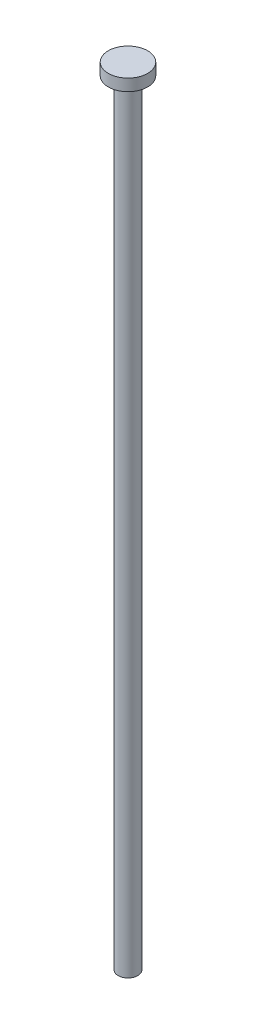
from build123d import *

# Parameters (mm, degrees)
PINDIA_R            = 2.5
LENGTH_DEPTH        = 200
HEADDIA_R           = 5
HEADTHICKNESS_DEPTH = 3
FILLET1_R           = 0.3


with BuildPart() as part:
    # PinDia → Length (new body)
    with BuildSketch(Plane(origin=(0, 0, 0), x_dir=(1, 0, 0), z_dir=(0, 1, 0))):
        with Locations(Location((0, 0, 0), (0, 0, 270))):
            Circle(PINDIA_R)
    extrude(amount=-LENGTH_DEPTH)

    # HeadDia → HeadThickness (add)
    with BuildSketch(Plane(origin=(0, 0, 0), x_dir=(1, 0, 0), z_dir=(0, 1, 0))):
        with Locations(Location((0, 0, 0), (0, 0, 270))):
            Circle(HEADDIA_R)
    extrude(amount=-HEADTHICKNESS_DEPTH)

    # Fillet1
    fillet1_edges = [part.edges().sort_by_distance(p)[0] for p in [
        (0, -3, -2.5),
    ]]
    fillet(fillet1_edges, radius=FILLET1_R)


solid = part.part
